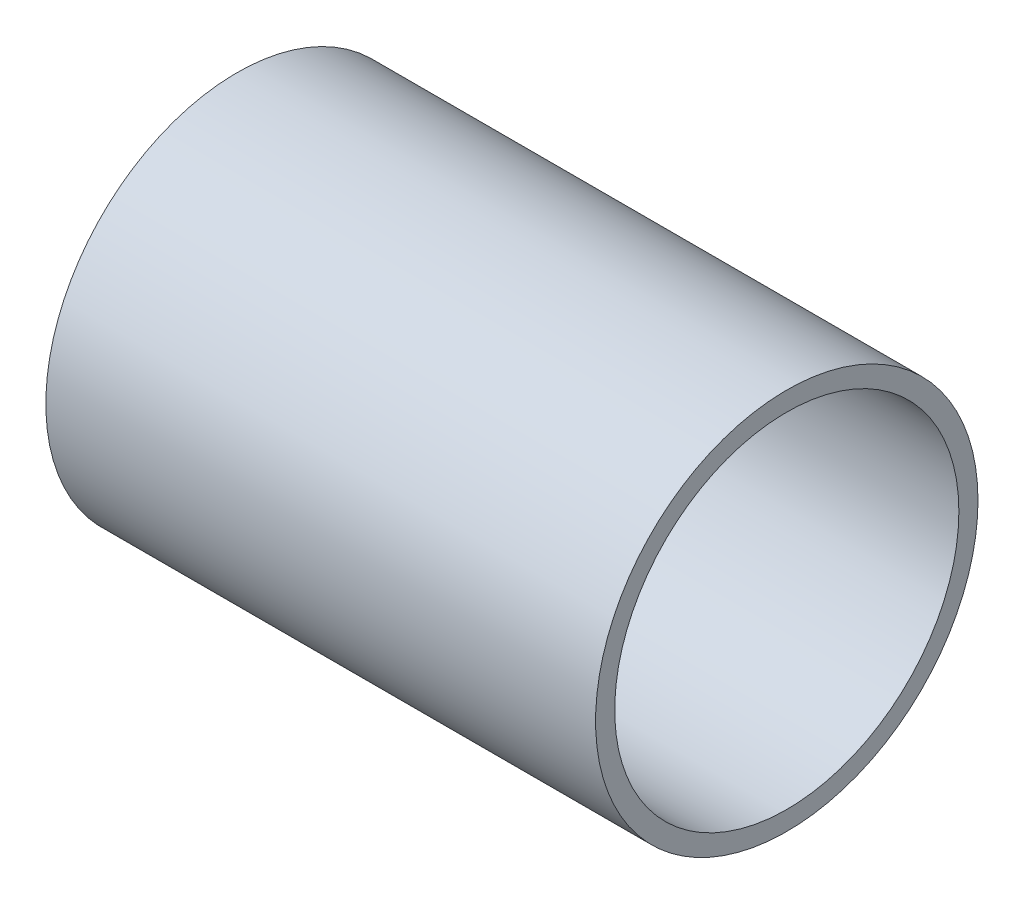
ISO-10303-21;
HEADER;
FILE_DESCRIPTION(('STEP AP214'),'2;1');
FILE_NAME('part.step','',(''),(''),'','','');
FILE_SCHEMA(('AUTOMOTIVE_DESIGN { 1 0 10303 214 1 1 1 1 }'));
ENDSEC;
DATA;
#1=APPLICATION_CONTEXT('core data for automotive mechanical design processes');
#2=APPLICATION_PROTOCOL_DEFINITION('international standard','automotive_design',2000,#1);
#3=PRODUCT_CONTEXT('',#1,'mechanical');
#4=PRODUCT('Part','Part','',(#3));
#5=PRODUCT_RELATED_PRODUCT_CATEGORY('part','',(#4));
#6=PRODUCT_DEFINITION_FORMATION('','',#4);
#7=PRODUCT_DEFINITION_CONTEXT('part definition',#1,'design');
#8=PRODUCT_DEFINITION('design','',#6,#7);
#9=PRODUCT_DEFINITION_SHAPE('','',#8);
#10=(LENGTH_UNIT() NAMED_UNIT(*) SI_UNIT(.MILLI.,.METRE.));
#11=(NAMED_UNIT(*) PLANE_ANGLE_UNIT() SI_UNIT($,.RADIAN.));
#12=(NAMED_UNIT(*) SI_UNIT($,.STERADIAN.) SOLID_ANGLE_UNIT());
#13=UNCERTAINTY_MEASURE_WITH_UNIT(LENGTH_MEASURE(1.E-05),#10,'distance_accuracy_value','');
#14=(GEOMETRIC_REPRESENTATION_CONTEXT(3) GLOBAL_UNCERTAINTY_ASSIGNED_CONTEXT((#13)) GLOBAL_UNIT_ASSIGNED_CONTEXT((#10,
#11,#12)) REPRESENTATION_CONTEXT('',''));
#15=CARTESIAN_POINT('',(0.,0.,0.));
#16=DIRECTION('',(0.,0.,1.));
#17=DIRECTION('',(1.,0.,0.));
#18=AXIS2_PLACEMENT_3D('',#15,#16,#17);
#19=CARTESIAN_POINT('',(28.75,0.,0.));
#20=DIRECTION('',(1.,0.,0.));
#21=DIRECTION('',(0.,0.,-1.));
#22=AXIS2_PLACEMENT_3D('',#19,#20,#21);
#23=CYLINDRICAL_SURFACE('',#22,18.);
#24=CARTESIAN_POINT('',(0.,0.,0.));
#25=DIRECTION('',(1.,0.,0.));
#26=DIRECTION('',(0.,0.,-1.));
#27=AXIS2_PLACEMENT_3D('',#24,#25,#26);
#28=CIRCLE('',#27,18.);
#29=CARTESIAN_POINT('',(0.,0.,-18.));
#30=VERTEX_POINT('',#29);
#31=EDGE_CURVE('E16',#30,#30,#28,.F.);
#32=ORIENTED_EDGE('',*,*,#31,.T.);
#33=EDGE_LOOP('',(#32));
#34=FACE_BOUND('',#33,.T.);
#35=CARTESIAN_POINT('',(57.5,0.,0.));
#36=DIRECTION('',(1.,0.,0.));
#37=DIRECTION('',(0.,0.,-1.));
#38=AXIS2_PLACEMENT_3D('',#35,#36,#37);
#39=CIRCLE('',#38,18.);
#40=CARTESIAN_POINT('',(57.5,0.,-18.));
#41=VERTEX_POINT('',#40);
#42=EDGE_CURVE('E25',#41,#41,#39,.F.);
#43=ORIENTED_EDGE('',*,*,#42,.F.);
#44=EDGE_LOOP('',(#43));
#45=FACE_BOUND('',#44,.T.);
#46=ADVANCED_FACE('F13',(#34,#45),#23,.F.);
#47=CARTESIAN_POINT('',(0.,0.,0.));
#48=DIRECTION('',(1.,0.,0.));
#49=DIRECTION('',(0.,0.,-1.));
#50=AXIS2_PLACEMENT_3D('',#47,#48,#49);
#51=PLANE('',#50);
#52=ORIENTED_EDGE('',*,*,#31,.F.);
#53=EDGE_LOOP('',(#52));
#54=FACE_BOUND('',#53,.T.);
#55=CARTESIAN_POINT('',(0.,0.,0.));
#56=DIRECTION('',(1.,0.,0.));
#57=DIRECTION('',(0.,0.,-1.));
#58=AXIS2_PLACEMENT_3D('',#55,#56,#57);
#59=CIRCLE('',#58,20.);
#60=CARTESIAN_POINT('',(0.,0.,-20.));
#61=VERTEX_POINT('',#60);
#62=EDGE_CURVE('E20',#61,#61,#59,.T.);
#63=ORIENTED_EDGE('',*,*,#62,.F.);
#64=EDGE_LOOP('',(#63));
#65=FACE_BOUND('',#64,.T.);
#66=ADVANCED_FACE('F35',(#54,#65),#51,.F.);
#67=CARTESIAN_POINT('',(57.5,0.,0.));
#68=DIRECTION('',(1.,0.,0.));
#69=DIRECTION('',(0.,0.,-1.));
#70=AXIS2_PLACEMENT_3D('',#67,#68,#69);
#71=PLANE('',#70);
#72=ORIENTED_EDGE('',*,*,#42,.T.);
#73=EDGE_LOOP('',(#72));
#74=FACE_BOUND('',#73,.T.);
#75=CARTESIAN_POINT('',(57.5,0.,0.));
#76=DIRECTION('',(1.,0.,0.));
#77=DIRECTION('',(0.,0.,-1.));
#78=AXIS2_PLACEMENT_3D('',#75,#76,#77);
#79=CIRCLE('',#78,20.);
#80=CARTESIAN_POINT('',(57.5,0.,-20.));
#81=VERTEX_POINT('',#80);
#82=EDGE_CURVE('E8',#81,#81,#79,.F.);
#83=ORIENTED_EDGE('',*,*,#82,.F.);
#84=EDGE_LOOP('',(#83));
#85=FACE_BOUND('',#84,.T.);
#86=ADVANCED_FACE('F38',(#74,#85),#71,.T.);
#87=CARTESIAN_POINT('',(28.75,0.,0.));
#88=DIRECTION('',(1.,0.,0.));
#89=DIRECTION('',(0.,0.,-1.));
#90=AXIS2_PLACEMENT_3D('',#87,#88,#89);
#91=CYLINDRICAL_SURFACE('',#90,20.);
#92=ORIENTED_EDGE('',*,*,#62,.T.);
#93=EDGE_LOOP('',(#92));
#94=FACE_BOUND('',#93,.T.);
#95=ORIENTED_EDGE('',*,*,#82,.T.);
#96=EDGE_LOOP('',(#95));
#97=FACE_BOUND('',#96,.T.);
#98=ADVANCED_FACE('F41',(#94,#97),#91,.T.);
#99=CLOSED_SHELL('',(#46,#66,#86,#98));
#100=MANIFOLD_SOLID_BREP('B1',#99);
#101=ADVANCED_BREP_SHAPE_REPRESENTATION('',(#18,#100),#14);
#102=SHAPE_DEFINITION_REPRESENTATION(#9,#101);
ENDSEC;
END-ISO-10303-21;
